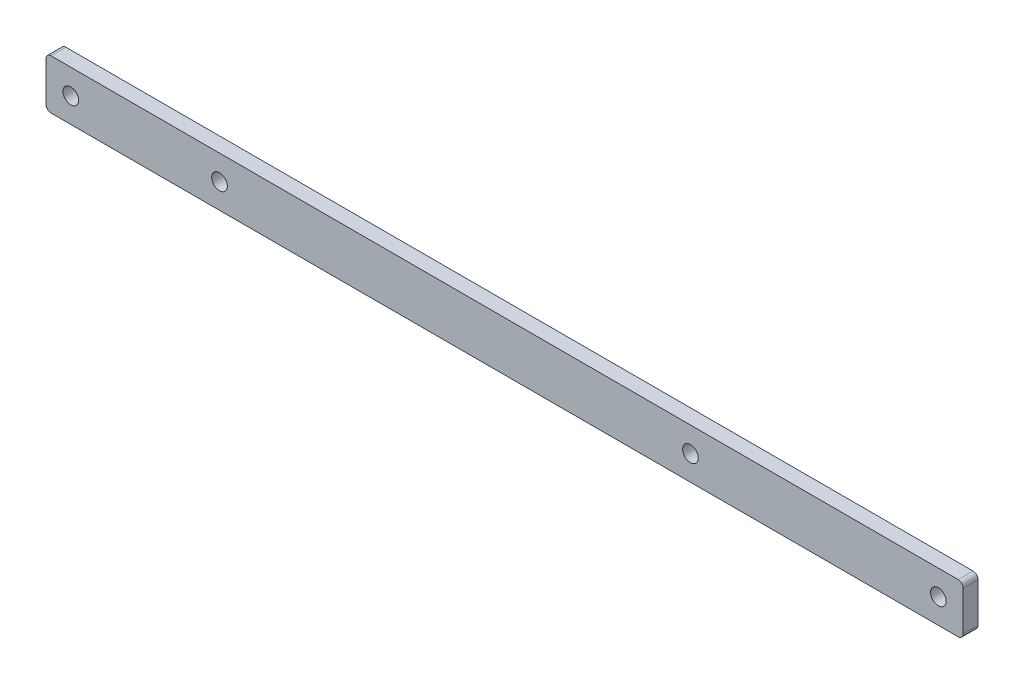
ISO-10303-21;
HEADER;
FILE_DESCRIPTION(('STEP AP214'),'2;1');
FILE_NAME('part.step','',(''),(''),'','','');
FILE_SCHEMA(('AUTOMOTIVE_DESIGN { 1 0 10303 214 1 1 1 1 }'));
ENDSEC;
DATA;
#1=APPLICATION_CONTEXT('core data for automotive mechanical design processes');
#2=APPLICATION_PROTOCOL_DEFINITION('international standard','automotive_design',2000,#1);
#3=PRODUCT_CONTEXT('',#1,'mechanical');
#4=PRODUCT('Part','Part','',(#3));
#5=PRODUCT_RELATED_PRODUCT_CATEGORY('part','',(#4));
#6=PRODUCT_DEFINITION_FORMATION('','',#4);
#7=PRODUCT_DEFINITION_CONTEXT('part definition',#1,'design');
#8=PRODUCT_DEFINITION('design','',#6,#7);
#9=PRODUCT_DEFINITION_SHAPE('','',#8);
#10=(LENGTH_UNIT() NAMED_UNIT(*) SI_UNIT(.MILLI.,.METRE.));
#11=(NAMED_UNIT(*) PLANE_ANGLE_UNIT() SI_UNIT($,.RADIAN.));
#12=(NAMED_UNIT(*) SI_UNIT($,.STERADIAN.) SOLID_ANGLE_UNIT());
#13=UNCERTAINTY_MEASURE_WITH_UNIT(LENGTH_MEASURE(1.E-05),#10,'distance_accuracy_value','');
#14=(GEOMETRIC_REPRESENTATION_CONTEXT(3) GLOBAL_UNCERTAINTY_ASSIGNED_CONTEXT((#13)) GLOBAL_UNIT_ASSIGNED_CONTEXT((#10,
#11,#12)) REPRESENTATION_CONTEXT('',''));
#15=CARTESIAN_POINT('',(0.,0.,0.));
#16=DIRECTION('',(0.,0.,1.));
#17=DIRECTION('',(1.,0.,0.));
#18=AXIS2_PLACEMENT_3D('',#15,#16,#17);
#19=CARTESIAN_POINT('',(0.,0.,7.62));
#20=DIRECTION('',(1.,0.,0.));
#21=DIRECTION('',(0.,0.,-1.));
#22=AXIS2_PLACEMENT_3D('',#19,#20,#21);
#23=PLANE('',#22);
#24=DIRECTION('',(0.,-1.,0.));
#25=VECTOR('',#24,1.);
#26=CARTESIAN_POINT('',(0.,0.,7.62));
#27=LINE('',#26,#25);
#28=CARTESIAN_POINT('',(0.,22.86,7.62));
#29=VERTEX_POINT('',#28);
#30=CARTESIAN_POINT('',(0.,2.54,7.62));
#31=VERTEX_POINT('',#30);
#32=EDGE_CURVE('E129',#29,#31,#27,.T.);
#33=ORIENTED_EDGE('',*,*,#32,.F.);
#34=DIRECTION('',(0.,0.,-1.));
#35=VECTOR('',#34,1.);
#36=CARTESIAN_POINT('',(0.,22.86,7.62));
#37=LINE('',#36,#35);
#38=CARTESIAN_POINT('',(0.,22.86,0.));
#39=VERTEX_POINT('',#38);
#40=EDGE_CURVE('E113',#29,#39,#37,.T.);
#41=ORIENTED_EDGE('',*,*,#40,.T.);
#42=DIRECTION('',(0.,-1.,0.));
#43=VECTOR('',#42,1.);
#44=CARTESIAN_POINT('',(0.,0.,0.));
#45=LINE('',#44,#43);
#46=CARTESIAN_POINT('',(0.,2.54,0.));
#47=VERTEX_POINT('',#46);
#48=EDGE_CURVE('E126',#39,#47,#45,.T.);
#49=ORIENTED_EDGE('',*,*,#48,.T.);
#50=DIRECTION('',(0.,0.,-1.));
#51=VECTOR('',#50,1.);
#52=CARTESIAN_POINT('',(0.,2.54,7.62));
#53=LINE('',#52,#51);
#54=EDGE_CURVE('E132',#47,#31,#53,.F.);
#55=ORIENTED_EDGE('',*,*,#54,.T.);
#56=EDGE_LOOP('',(#33,#41,#49,#55));
#57=FACE_BOUND('',#56,.T.);
#58=ADVANCED_FACE('F42',(#57),#23,.F.);
#59=CARTESIAN_POINT('',(0.,0.,7.62));
#60=DIRECTION('',(0.,1.,0.));
#61=DIRECTION('',(0.,0.,1.));
#62=AXIS2_PLACEMENT_3D('',#59,#60,#61);
#63=PLANE('',#62);
#64=DIRECTION('',(1.,0.,0.));
#65=VECTOR('',#64,1.);
#66=CARTESIAN_POINT('',(0.,0.,7.62));
#67=LINE('',#66,#65);
#68=CARTESIAN_POINT('',(2.54,0.,7.62));
#69=VERTEX_POINT('',#68);
#70=CARTESIAN_POINT('',(467.36,0.,7.62));
#71=VERTEX_POINT('',#70);
#72=EDGE_CURVE('E194',#69,#71,#67,.T.);
#73=ORIENTED_EDGE('',*,*,#72,.F.);
#74=DIRECTION('',(0.,0.,-1.));
#75=VECTOR('',#74,1.);
#76=CARTESIAN_POINT('',(2.54,0.,7.62));
#77=LINE('',#76,#75);
#78=CARTESIAN_POINT('',(2.54,0.,0.));
#79=VERTEX_POINT('',#78);
#80=EDGE_CURVE('E185',#69,#79,#77,.T.);
#81=ORIENTED_EDGE('',*,*,#80,.T.);
#82=DIRECTION('',(1.,0.,0.));
#83=VECTOR('',#82,1.);
#84=CARTESIAN_POINT('',(0.,0.,0.));
#85=LINE('',#84,#83);
#86=CARTESIAN_POINT('',(467.36,0.,0.));
#87=VERTEX_POINT('',#86);
#88=EDGE_CURVE('E137',#79,#87,#85,.T.);
#89=ORIENTED_EDGE('',*,*,#88,.T.);
#90=DIRECTION('',(0.,0.,-1.));
#91=VECTOR('',#90,1.);
#92=CARTESIAN_POINT('',(467.36,0.,7.62));
#93=LINE('',#92,#91);
#94=EDGE_CURVE('E182',#87,#71,#93,.F.);
#95=ORIENTED_EDGE('',*,*,#94,.T.);
#96=EDGE_LOOP('',(#73,#81,#89,#95));
#97=FACE_BOUND('',#96,.T.);
#98=ADVANCED_FACE('F260',(#97),#63,.F.);
#99=CARTESIAN_POINT('',(469.9,0.,7.62));
#100=DIRECTION('',(-1.,0.,0.));
#101=DIRECTION('',(0.,0.,1.));
#102=AXIS2_PLACEMENT_3D('',#99,#100,#101);
#103=PLANE('',#102);
#104=DIRECTION('',(0.,1.,0.));
#105=VECTOR('',#104,1.);
#106=CARTESIAN_POINT('',(469.9,0.,7.62));
#107=LINE('',#106,#105);
#108=CARTESIAN_POINT('',(469.9,2.54,7.62));
#109=VERTEX_POINT('',#108);
#110=CARTESIAN_POINT('',(469.9,22.86,7.62));
#111=VERTEX_POINT('',#110);
#112=EDGE_CURVE('E192',#109,#111,#107,.T.);
#113=ORIENTED_EDGE('',*,*,#112,.F.);
#114=DIRECTION('',(0.,0.,-1.));
#115=VECTOR('',#114,1.);
#116=CARTESIAN_POINT('',(469.9,2.54,7.62));
#117=LINE('',#116,#115);
#118=CARTESIAN_POINT('',(469.9,2.54,0.));
#119=VERTEX_POINT('',#118);
#120=EDGE_CURVE('E11',#109,#119,#117,.T.);
#121=ORIENTED_EDGE('',*,*,#120,.T.);
#122=DIRECTION('',(0.,1.,0.));
#123=VECTOR('',#122,1.);
#124=CARTESIAN_POINT('',(469.9,0.,0.));
#125=LINE('',#124,#123);
#126=CARTESIAN_POINT('',(469.9,22.86,0.));
#127=VERTEX_POINT('',#126);
#128=EDGE_CURVE('E143',#119,#127,#125,.T.);
#129=ORIENTED_EDGE('',*,*,#128,.T.);
#130=DIRECTION('',(0.,0.,-1.));
#131=VECTOR('',#130,1.);
#132=CARTESIAN_POINT('',(469.9,22.86,7.62));
#133=LINE('',#132,#131);
#134=EDGE_CURVE('E51',#127,#111,#133,.F.);
#135=ORIENTED_EDGE('',*,*,#134,.T.);
#136=EDGE_LOOP('',(#113,#121,#129,#135));
#137=FACE_BOUND('',#136,.T.);
#138=ADVANCED_FACE('F253',(#137),#103,.F.);
#139=CARTESIAN_POINT('',(0.,25.4,7.62));
#140=DIRECTION('',(0.,-1.,0.));
#141=DIRECTION('',(0.,0.,-1.));
#142=AXIS2_PLACEMENT_3D('',#139,#140,#141);
#143=PLANE('',#142);
#144=DIRECTION('',(-1.,0.,0.));
#145=VECTOR('',#144,1.);
#146=CARTESIAN_POINT('',(0.,25.4,0.));
#147=LINE('',#146,#145);
#148=CARTESIAN_POINT('',(467.36,25.4,0.));
#149=VERTEX_POINT('',#148);
#150=CARTESIAN_POINT('',(2.54,25.4,0.));
#151=VERTEX_POINT('',#150);
#152=EDGE_CURVE('E154',#149,#151,#147,.T.);
#153=ORIENTED_EDGE('',*,*,#152,.T.);
#154=DIRECTION('',(0.,0.,-1.));
#155=VECTOR('',#154,1.);
#156=CARTESIAN_POINT('',(2.54,25.4,7.62));
#157=LINE('',#156,#155);
#158=CARTESIAN_POINT('',(2.54,25.4,7.62));
#159=VERTEX_POINT('',#158);
#160=EDGE_CURVE('E114',#151,#159,#157,.F.);
#161=ORIENTED_EDGE('',*,*,#160,.T.);
#162=DIRECTION('',(-1.,0.,0.));
#163=VECTOR('',#162,1.);
#164=CARTESIAN_POINT('',(0.,25.4,7.62));
#165=LINE('',#164,#163);
#166=CARTESIAN_POINT('',(467.36,25.4,7.62));
#167=VERTEX_POINT('',#166);
#168=EDGE_CURVE('E149',#167,#159,#165,.T.);
#169=ORIENTED_EDGE('',*,*,#168,.F.);
#170=DIRECTION('',(0.,0.,-1.));
#171=VECTOR('',#170,1.);
#172=CARTESIAN_POINT('',(467.36,25.4,7.62));
#173=LINE('',#172,#171);
#174=EDGE_CURVE('E120',#167,#149,#173,.T.);
#175=ORIENTED_EDGE('',*,*,#174,.T.);
#176=EDGE_LOOP('',(#153,#161,#169,#175));
#177=FACE_BOUND('',#176,.T.);
#178=ADVANCED_FACE('F240',(#177),#143,.F.);
#179=CARTESIAN_POINT('',(0.,0.,7.62));
#180=DIRECTION('',(0.,0.,-1.));
#181=DIRECTION('',(-1.,0.,0.));
#182=AXIS2_PLACEMENT_3D('',#179,#180,#181);
#183=PLANE('',#182);
#184=CARTESIAN_POINT('',(88.9,12.7,7.62));
#185=DIRECTION('',(0.,0.,1.));
#186=DIRECTION('',(1.,0.,0.));
#187=AXIS2_PLACEMENT_3D('',#184,#185,#186);
#188=CIRCLE('',#187,4.00000000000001);
#189=CARTESIAN_POINT('',(92.9,12.7,7.62));
#190=VERTEX_POINT('',#189);
#191=EDGE_CURVE('E220',#190,#190,#188,.T.);
#192=ORIENTED_EDGE('',*,*,#191,.F.);
#193=EDGE_LOOP('',(#192));
#194=FACE_BOUND('',#193,.T.);
#195=CARTESIAN_POINT('',(330.2,12.7,7.62));
#196=DIRECTION('',(0.,0.,1.));
#197=DIRECTION('',(1.,0.,0.));
#198=AXIS2_PLACEMENT_3D('',#195,#196,#197);
#199=CIRCLE('',#198,3.99999999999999);
#200=CARTESIAN_POINT('',(334.2,12.7,7.62));
#201=VERTEX_POINT('',#200);
#202=EDGE_CURVE('E216',#201,#201,#199,.T.);
#203=ORIENTED_EDGE('',*,*,#202,.F.);
#204=EDGE_LOOP('',(#203));
#205=FACE_BOUND('',#204,.T.);
#206=CARTESIAN_POINT('',(457.2,12.6999999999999,7.62));
#207=DIRECTION('',(0.,0.,-1.));
#208=DIRECTION('',(-1.,0.,0.));
#209=AXIS2_PLACEMENT_3D('',#206,#207,#208);
#210=CIRCLE('',#209,4.);
#211=CARTESIAN_POINT('',(461.2,12.6999999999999,7.62));
#212=VERTEX_POINT('',#211);
#213=EDGE_CURVE('E204',#212,#212,#210,.T.);
#214=ORIENTED_EDGE('',*,*,#213,.T.);
#215=EDGE_LOOP('',(#214));
#216=FACE_BOUND('',#215,.T.);
#217=CARTESIAN_POINT('',(12.7,12.6999999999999,7.62));
#218=DIRECTION('',(0.,0.,1.));
#219=DIRECTION('',(1.,0.,0.));
#220=AXIS2_PLACEMENT_3D('',#217,#218,#219);
#221=CIRCLE('',#220,4.);
#222=CARTESIAN_POINT('',(16.7,12.6999999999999,7.62));
#223=VERTEX_POINT('',#222);
#224=EDGE_CURVE('E146',#223,#223,#221,.T.);
#225=ORIENTED_EDGE('',*,*,#224,.F.);
#226=EDGE_LOOP('',(#225));
#227=FACE_BOUND('',#226,.T.);
#228=ORIENTED_EDGE('',*,*,#168,.T.);
#229=CARTESIAN_POINT('',(2.54,22.86,7.62));
#230=DIRECTION('',(0.,0.,-1.));
#231=DIRECTION('',(-1.,0.,0.));
#232=AXIS2_PLACEMENT_3D('',#229,#230,#231);
#233=CIRCLE('',#232,2.54);
#234=EDGE_CURVE('E179',#159,#29,#233,.F.);
#235=ORIENTED_EDGE('',*,*,#234,.T.);
#236=ORIENTED_EDGE('',*,*,#32,.T.);
#237=CARTESIAN_POINT('',(2.54,2.54,7.62));
#238=DIRECTION('',(0.,0.,-1.));
#239=DIRECTION('',(-1.,0.,0.));
#240=AXIS2_PLACEMENT_3D('',#237,#238,#239);
#241=CIRCLE('',#240,2.54);
#242=EDGE_CURVE('E176',#31,#69,#241,.F.);
#243=ORIENTED_EDGE('',*,*,#242,.T.);
#244=ORIENTED_EDGE('',*,*,#72,.T.);
#245=CARTESIAN_POINT('',(467.36,2.54,7.62));
#246=DIRECTION('',(0.,0.,-1.));
#247=DIRECTION('',(-1.,0.,0.));
#248=AXIS2_PLACEMENT_3D('',#245,#246,#247);
#249=CIRCLE('',#248,2.54);
#250=EDGE_CURVE('E64',#71,#109,#249,.F.);
#251=ORIENTED_EDGE('',*,*,#250,.T.);
#252=ORIENTED_EDGE('',*,*,#112,.T.);
#253=CARTESIAN_POINT('',(467.36,22.86,7.62));
#254=DIRECTION('',(0.,0.,-1.));
#255=DIRECTION('',(-1.,0.,0.));
#256=AXIS2_PLACEMENT_3D('',#253,#254,#255);
#257=CIRCLE('',#256,2.54);
#258=EDGE_CURVE('E171',#111,#167,#257,.F.);
#259=ORIENTED_EDGE('',*,*,#258,.T.);
#260=EDGE_LOOP('',(#228,#235,#236,#243,#244,#251,#252,#259));
#261=FACE_BOUND('',#260,.T.);
#262=ADVANCED_FACE('F237',(#194,#205,#216,#227,#261),#183,.F.);
#263=CARTESIAN_POINT('',(0.,0.,0.));
#264=DIRECTION('',(0.,0.,-1.));
#265=DIRECTION('',(-1.,0.,0.));
#266=AXIS2_PLACEMENT_3D('',#263,#264,#265);
#267=PLANE('',#266);
#268=CARTESIAN_POINT('',(88.9,12.7,0.));
#269=DIRECTION('',(0.,0.,1.));
#270=DIRECTION('',(1.,0.,0.));
#271=AXIS2_PLACEMENT_3D('',#268,#269,#270);
#272=CIRCLE('',#271,4.00000000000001);
#273=CARTESIAN_POINT('',(92.9,12.7,0.));
#274=VERTEX_POINT('',#273);
#275=EDGE_CURVE('E208',#274,#274,#272,.T.);
#276=ORIENTED_EDGE('',*,*,#275,.T.);
#277=EDGE_LOOP('',(#276));
#278=FACE_BOUND('',#277,.T.);
#279=CARTESIAN_POINT('',(330.2,12.7,0.));
#280=DIRECTION('',(0.,0.,1.));
#281=DIRECTION('',(1.,0.,0.));
#282=AXIS2_PLACEMENT_3D('',#279,#280,#281);
#283=CIRCLE('',#282,3.99999999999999);
#284=CARTESIAN_POINT('',(334.2,12.7,0.));
#285=VERTEX_POINT('',#284);
#286=EDGE_CURVE('E212',#285,#285,#283,.T.);
#287=ORIENTED_EDGE('',*,*,#286,.T.);
#288=EDGE_LOOP('',(#287));
#289=FACE_BOUND('',#288,.T.);
#290=CARTESIAN_POINT('',(457.2,12.6999999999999,0.));
#291=DIRECTION('',(0.,0.,-1.));
#292=DIRECTION('',(-1.,0.,0.));
#293=AXIS2_PLACEMENT_3D('',#290,#291,#292);
#294=CIRCLE('',#293,4.);
#295=CARTESIAN_POINT('',(461.2,12.6999999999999,0.));
#296=VERTEX_POINT('',#295);
#297=EDGE_CURVE('E202',#296,#296,#294,.T.);
#298=ORIENTED_EDGE('',*,*,#297,.F.);
#299=EDGE_LOOP('',(#298));
#300=FACE_BOUND('',#299,.T.);
#301=CARTESIAN_POINT('',(12.7,12.6999999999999,0.));
#302=DIRECTION('',(0.,0.,1.));
#303=DIRECTION('',(1.,0.,0.));
#304=AXIS2_PLACEMENT_3D('',#301,#302,#303);
#305=CIRCLE('',#304,4.);
#306=CARTESIAN_POINT('',(16.7,12.6999999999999,0.));
#307=VERTEX_POINT('',#306);
#308=EDGE_CURVE('E138',#307,#307,#305,.T.);
#309=ORIENTED_EDGE('',*,*,#308,.T.);
#310=EDGE_LOOP('',(#309));
#311=FACE_BOUND('',#310,.T.);
#312=ORIENTED_EDGE('',*,*,#48,.F.);
#313=CARTESIAN_POINT('',(2.54,22.86,0.));
#314=DIRECTION('',(0.,0.,-1.));
#315=DIRECTION('',(-1.,0.,0.));
#316=AXIS2_PLACEMENT_3D('',#313,#314,#315);
#317=CIRCLE('',#316,2.54);
#318=EDGE_CURVE('E109',#39,#151,#317,.T.);
#319=ORIENTED_EDGE('',*,*,#318,.T.);
#320=ORIENTED_EDGE('',*,*,#152,.F.);
#321=CARTESIAN_POINT('',(467.36,22.86,0.));
#322=DIRECTION('',(0.,0.,-1.));
#323=DIRECTION('',(-1.,0.,0.));
#324=AXIS2_PLACEMENT_3D('',#321,#322,#323);
#325=CIRCLE('',#324,2.54);
#326=EDGE_CURVE('E131',#149,#127,#325,.T.);
#327=ORIENTED_EDGE('',*,*,#326,.T.);
#328=ORIENTED_EDGE('',*,*,#128,.F.);
#329=CARTESIAN_POINT('',(467.36,2.54,0.));
#330=DIRECTION('',(0.,0.,-1.));
#331=DIRECTION('',(-1.,0.,0.));
#332=AXIS2_PLACEMENT_3D('',#329,#330,#331);
#333=CIRCLE('',#332,2.54);
#334=EDGE_CURVE('E161',#119,#87,#333,.T.);
#335=ORIENTED_EDGE('',*,*,#334,.T.);
#336=ORIENTED_EDGE('',*,*,#88,.F.);
#337=CARTESIAN_POINT('',(2.54,2.54,0.));
#338=DIRECTION('',(0.,0.,-1.));
#339=DIRECTION('',(-1.,0.,0.));
#340=AXIS2_PLACEMENT_3D('',#337,#338,#339);
#341=CIRCLE('',#340,2.54);
#342=EDGE_CURVE('E121',#79,#47,#341,.T.);
#343=ORIENTED_EDGE('',*,*,#342,.T.);
#344=EDGE_LOOP('',(#312,#319,#320,#327,#328,#335,#336,#343));
#345=FACE_BOUND('',#344,.T.);
#346=ADVANCED_FACE('F134',(#278,#289,#300,#311,#345),#267,.T.);
#347=CARTESIAN_POINT('',(12.7,12.6999999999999,0.));
#348=DIRECTION('',(0.,0.,1.));
#349=DIRECTION('',(1.,0.,0.));
#350=AXIS2_PLACEMENT_3D('',#347,#348,#349);
#351=CYLINDRICAL_SURFACE('',#350,4.);
#352=CARTESIAN_POINT('',(16.7,12.6999999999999,0.));
#353=CARTESIAN_POINT('',(16.7,12.6999999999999,0.0793749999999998));
#354=CARTESIAN_POINT('',(16.7,12.6999999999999,0.15875));
#355=CARTESIAN_POINT('',(16.7,12.6999999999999,0.3175));
#356=CARTESIAN_POINT('',(16.7,12.6999999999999,0.396875));
#357=CARTESIAN_POINT('',(16.7,12.6999999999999,0.555625));
#358=CARTESIAN_POINT('',(16.7,12.6999999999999,0.635));
#359=CARTESIAN_POINT('',(16.7,12.6999999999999,0.79375));
#360=CARTESIAN_POINT('',(16.7,12.6999999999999,0.873125));
#361=CARTESIAN_POINT('',(16.7,12.6999999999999,1.031875));
#362=CARTESIAN_POINT('',(16.7,12.6999999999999,1.11125));
#363=CARTESIAN_POINT('',(16.7,12.6999999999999,1.27));
#364=CARTESIAN_POINT('',(16.7,12.6999999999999,1.349375));
#365=CARTESIAN_POINT('',(16.7,12.6999999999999,1.508125));
#366=CARTESIAN_POINT('',(16.7,12.6999999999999,1.5875));
#367=CARTESIAN_POINT('',(16.7,12.6999999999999,1.74625));
#368=CARTESIAN_POINT('',(16.7,12.6999999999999,1.825625));
#369=CARTESIAN_POINT('',(16.7,12.6999999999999,1.984375));
#370=CARTESIAN_POINT('',(16.7,12.6999999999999,2.06375));
#371=CARTESIAN_POINT('',(16.7,12.6999999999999,2.2225));
#372=CARTESIAN_POINT('',(16.7,12.6999999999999,2.301875));
#373=CARTESIAN_POINT('',(16.7,12.6999999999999,2.460625));
#374=CARTESIAN_POINT('',(16.7,12.6999999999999,2.54));
#375=CARTESIAN_POINT('',(16.7,12.6999999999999,2.69875));
#376=CARTESIAN_POINT('',(16.7,12.6999999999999,2.778125));
#377=CARTESIAN_POINT('',(16.7,12.6999999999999,2.936875));
#378=CARTESIAN_POINT('',(16.7,12.6999999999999,3.01625));
#379=CARTESIAN_POINT('',(16.7,12.6999999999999,3.175));
#380=CARTESIAN_POINT('',(16.7,12.6999999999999,3.254375));
#381=CARTESIAN_POINT('',(16.7,12.6999999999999,3.413125));
#382=CARTESIAN_POINT('',(16.7,12.6999999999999,3.4925));
#383=CARTESIAN_POINT('',(16.7,12.6999999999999,3.65125));
#384=CARTESIAN_POINT('',(16.7,12.6999999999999,3.730625));
#385=CARTESIAN_POINT('',(16.7,12.6999999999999,3.889375));
#386=CARTESIAN_POINT('',(16.7,12.6999999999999,3.96875));
#387=CARTESIAN_POINT('',(16.7,12.6999999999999,4.1275));
#388=CARTESIAN_POINT('',(16.7,12.6999999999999,4.206875));
#389=CARTESIAN_POINT('',(16.7,12.6999999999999,4.365625));
#390=CARTESIAN_POINT('',(16.7,12.6999999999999,4.445));
#391=CARTESIAN_POINT('',(16.7,12.6999999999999,4.60375));
#392=CARTESIAN_POINT('',(16.7,12.6999999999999,4.683125));
#393=CARTESIAN_POINT('',(16.7,12.6999999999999,4.841875));
#394=CARTESIAN_POINT('',(16.7,12.6999999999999,4.92125));
#395=CARTESIAN_POINT('',(16.7,12.6999999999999,5.08));
#396=CARTESIAN_POINT('',(16.7,12.6999999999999,5.159375));
#397=CARTESIAN_POINT('',(16.7,12.6999999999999,5.318125));
#398=CARTESIAN_POINT('',(16.7,12.6999999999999,5.3975));
#399=CARTESIAN_POINT('',(16.7,12.6999999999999,5.55625));
#400=CARTESIAN_POINT('',(16.7,12.6999999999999,5.635625));
#401=CARTESIAN_POINT('',(16.7,12.6999999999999,5.794375));
#402=CARTESIAN_POINT('',(16.7,12.6999999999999,5.87375));
#403=CARTESIAN_POINT('',(16.7,12.6999999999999,6.0325));
#404=CARTESIAN_POINT('',(16.7,12.6999999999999,6.111875));
#405=CARTESIAN_POINT('',(16.7,12.6999999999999,6.270625));
#406=CARTESIAN_POINT('',(16.7,12.6999999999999,6.35));
#407=CARTESIAN_POINT('',(16.7,12.6999999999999,6.50875));
#408=CARTESIAN_POINT('',(16.7,12.6999999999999,6.588125));
#409=CARTESIAN_POINT('',(16.7,12.6999999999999,6.746875));
#410=CARTESIAN_POINT('',(16.7,12.6999999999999,6.82625));
#411=CARTESIAN_POINT('',(16.7,12.6999999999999,6.985));
#412=CARTESIAN_POINT('',(16.7,12.6999999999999,7.064375));
#413=CARTESIAN_POINT('',(16.7,12.6999999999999,7.223125));
#414=CARTESIAN_POINT('',(16.7,12.6999999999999,7.3025));
#415=CARTESIAN_POINT('',(16.7,12.6999999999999,7.46125));
#416=CARTESIAN_POINT('',(16.7,12.6999999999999,7.540625));
#417=CARTESIAN_POINT('',(16.7,12.6999999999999,7.62));
#418=B_SPLINE_CURVE_WITH_KNOTS('',3,(#352,#353,#354,#355,#356,#357,#358,#359,#360,#361,#362,
#363,#364,#365,#366,#367,#368,#369,#370,#371,#372,#373,#374,#375,#376,#377,#378,#379,#380,#381,
#382,#383,#384,#385,#386,#387,#388,#389,#390,#391,#392,#393,#394,#395,#396,#397,#398,#399,#400,
#401,#402,#403,#404,#405,#406,#407,#408,#409,#410,#411,#412,#413,#414,#415,#416,#417),
.UNSPECIFIED.,.F.,.F.,(4,2,2,2,2,2,2,2,2,2,2,2,2,2,2,2,2,2,2,2,2,2,2,2,2,2,2,2,2,2,2,2,4),(0.,
0.238125,0.47625,0.714375,0.9525,1.190625,1.42875,1.666875,1.905,2.143125,2.38125,2.619375,
2.8575,3.095625,3.33375,3.571875,3.81,4.048125,4.28625,4.524375,4.7625,5.000625,5.23875,
5.476875,5.715,5.953125,6.19125,6.429375,6.6675,6.905625,7.14375,7.381875,7.62),.UNSPECIFIED.);
#419=EDGE_CURVE('BSEAM284',#307,#223,#418,.T.);
#420=ORIENTED_EDGE('',*,*,#308,.F.);
#421=ORIENTED_EDGE('',*,*,#224,.T.);
#422=ORIENTED_EDGE('',*,*,#419,.T.);
#423=ORIENTED_EDGE('',*,*,#419,.F.);
#424=EDGE_LOOP('',(#420,#422,#421,#423));
#425=FACE_BOUND('',#424,.T.);
#426=ADVANCED_FACE('F284',(#425),#351,.F.);
#427=CARTESIAN_POINT('',(457.2,12.6999999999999,0.));
#428=DIRECTION('',(0.,0.,1.));
#429=DIRECTION('',(1.,0.,0.));
#430=AXIS2_PLACEMENT_3D('',#427,#428,#429);
#431=CYLINDRICAL_SURFACE('',#430,4.);
#432=CARTESIAN_POINT('',(461.2,12.6999999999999,0.));
#433=CARTESIAN_POINT('',(461.2,12.6999999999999,0.0793749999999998));
#434=CARTESIAN_POINT('',(461.2,12.6999999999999,0.15875));
#435=CARTESIAN_POINT('',(461.2,12.6999999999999,0.3175));
#436=CARTESIAN_POINT('',(461.2,12.6999999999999,0.396875));
#437=CARTESIAN_POINT('',(461.2,12.6999999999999,0.555625));
#438=CARTESIAN_POINT('',(461.2,12.6999999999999,0.635));
#439=CARTESIAN_POINT('',(461.2,12.6999999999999,0.79375));
#440=CARTESIAN_POINT('',(461.2,12.6999999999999,0.873125));
#441=CARTESIAN_POINT('',(461.2,12.6999999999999,1.031875));
#442=CARTESIAN_POINT('',(461.2,12.6999999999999,1.11125));
#443=CARTESIAN_POINT('',(461.2,12.6999999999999,1.27));
#444=CARTESIAN_POINT('',(461.2,12.6999999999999,1.349375));
#445=CARTESIAN_POINT('',(461.2,12.6999999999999,1.508125));
#446=CARTESIAN_POINT('',(461.2,12.6999999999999,1.5875));
#447=CARTESIAN_POINT('',(461.2,12.6999999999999,1.74625));
#448=CARTESIAN_POINT('',(461.2,12.6999999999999,1.825625));
#449=CARTESIAN_POINT('',(461.2,12.6999999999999,1.984375));
#450=CARTESIAN_POINT('',(461.2,12.6999999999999,2.06375));
#451=CARTESIAN_POINT('',(461.2,12.6999999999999,2.2225));
#452=CARTESIAN_POINT('',(461.2,12.6999999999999,2.301875));
#453=CARTESIAN_POINT('',(461.2,12.6999999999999,2.460625));
#454=CARTESIAN_POINT('',(461.2,12.6999999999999,2.54));
#455=CARTESIAN_POINT('',(461.2,12.6999999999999,2.69875));
#456=CARTESIAN_POINT('',(461.2,12.6999999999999,2.778125));
#457=CARTESIAN_POINT('',(461.2,12.6999999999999,2.936875));
#458=CARTESIAN_POINT('',(461.2,12.6999999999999,3.01625));
#459=CARTESIAN_POINT('',(461.2,12.6999999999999,3.175));
#460=CARTESIAN_POINT('',(461.2,12.6999999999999,3.254375));
#461=CARTESIAN_POINT('',(461.2,12.6999999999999,3.413125));
#462=CARTESIAN_POINT('',(461.2,12.6999999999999,3.4925));
#463=CARTESIAN_POINT('',(461.2,12.6999999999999,3.65125));
#464=CARTESIAN_POINT('',(461.2,12.6999999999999,3.730625));
#465=CARTESIAN_POINT('',(461.2,12.6999999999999,3.889375));
#466=CARTESIAN_POINT('',(461.2,12.6999999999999,3.96875));
#467=CARTESIAN_POINT('',(461.2,12.6999999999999,4.1275));
#468=CARTESIAN_POINT('',(461.2,12.6999999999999,4.206875));
#469=CARTESIAN_POINT('',(461.2,12.6999999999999,4.365625));
#470=CARTESIAN_POINT('',(461.2,12.6999999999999,4.445));
#471=CARTESIAN_POINT('',(461.2,12.6999999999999,4.60375));
#472=CARTESIAN_POINT('',(461.2,12.6999999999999,4.683125));
#473=CARTESIAN_POINT('',(461.2,12.6999999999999,4.841875));
#474=CARTESIAN_POINT('',(461.2,12.6999999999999,4.92125));
#475=CARTESIAN_POINT('',(461.2,12.6999999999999,5.08));
#476=CARTESIAN_POINT('',(461.2,12.6999999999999,5.159375));
#477=CARTESIAN_POINT('',(461.2,12.6999999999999,5.318125));
#478=CARTESIAN_POINT('',(461.2,12.6999999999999,5.3975));
#479=CARTESIAN_POINT('',(461.2,12.6999999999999,5.55625));
#480=CARTESIAN_POINT('',(461.2,12.6999999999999,5.635625));
#481=CARTESIAN_POINT('',(461.2,12.6999999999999,5.794375));
#482=CARTESIAN_POINT('',(461.2,12.6999999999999,5.87375));
#483=CARTESIAN_POINT('',(461.2,12.6999999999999,6.0325));
#484=CARTESIAN_POINT('',(461.2,12.6999999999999,6.111875));
#485=CARTESIAN_POINT('',(461.2,12.6999999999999,6.270625));
#486=CARTESIAN_POINT('',(461.2,12.6999999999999,6.35));
#487=CARTESIAN_POINT('',(461.2,12.6999999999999,6.50875));
#488=CARTESIAN_POINT('',(461.2,12.6999999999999,6.588125));
#489=CARTESIAN_POINT('',(461.2,12.6999999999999,6.746875));
#490=CARTESIAN_POINT('',(461.2,12.6999999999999,6.82625));
#491=CARTESIAN_POINT('',(461.2,12.6999999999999,6.985));
#492=CARTESIAN_POINT('',(461.2,12.6999999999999,7.064375));
#493=CARTESIAN_POINT('',(461.2,12.6999999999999,7.223125));
#494=CARTESIAN_POINT('',(461.2,12.6999999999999,7.3025));
#495=CARTESIAN_POINT('',(461.2,12.6999999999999,7.46125));
#496=CARTESIAN_POINT('',(461.2,12.6999999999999,7.540625));
#497=CARTESIAN_POINT('',(461.2,12.6999999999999,7.62));
#498=B_SPLINE_CURVE_WITH_KNOTS('',3,(#432,#433,#434,#435,#436,#437,#438,#439,#440,#441,#442,
#443,#444,#445,#446,#447,#448,#449,#450,#451,#452,#453,#454,#455,#456,#457,#458,#459,#460,#461,
#462,#463,#464,#465,#466,#467,#468,#469,#470,#471,#472,#473,#474,#475,#476,#477,#478,#479,#480,
#481,#482,#483,#484,#485,#486,#487,#488,#489,#490,#491,#492,#493,#494,#495,#496,#497),
.UNSPECIFIED.,.F.,.F.,(4,2,2,2,2,2,2,2,2,2,2,2,2,2,2,2,2,2,2,2,2,2,2,2,2,2,2,2,2,2,2,2,4),(0.,
0.238125,0.47625,0.714375,0.9525,1.190625,1.42875,1.666875,1.905,2.143125,2.38125,2.619375,
2.8575,3.095625,3.33375,3.571875,3.81,4.048125,4.28625,4.524375,4.7625,5.000625,5.23875,
5.476875,5.715,5.953125,6.19125,6.429375,6.6675,6.905625,7.14375,7.381875,7.62),.UNSPECIFIED.);
#499=EDGE_CURVE('BSEAM270',#296,#212,#498,.T.);
#500=ORIENTED_EDGE('',*,*,#297,.T.);
#501=ORIENTED_EDGE('',*,*,#213,.F.);
#502=ORIENTED_EDGE('',*,*,#499,.T.);
#503=ORIENTED_EDGE('',*,*,#499,.F.);
#504=EDGE_LOOP('',(#500,#502,#501,#503));
#505=FACE_BOUND('',#504,.T.);
#506=ADVANCED_FACE('F270',(#505),#431,.F.);
#507=CARTESIAN_POINT('',(2.54,22.86,7.62));
#508=DIRECTION('',(0.,0.,-1.));
#509=DIRECTION('',(-1.,0.,0.));
#510=AXIS2_PLACEMENT_3D('',#507,#508,#509);
#511=CYLINDRICAL_SURFACE('',#510,2.54);
#512=ORIENTED_EDGE('',*,*,#234,.F.);
#513=ORIENTED_EDGE('',*,*,#160,.F.);
#514=ORIENTED_EDGE('',*,*,#318,.F.);
#515=ORIENTED_EDGE('',*,*,#40,.F.);
#516=EDGE_LOOP('',(#512,#513,#514,#515));
#517=FACE_BOUND('',#516,.T.);
#518=ADVANCED_FACE('F112',(#517),#511,.T.);
#519=CARTESIAN_POINT('',(2.54,2.54,7.62));
#520=DIRECTION('',(0.,0.,-1.));
#521=DIRECTION('',(-1.,0.,0.));
#522=AXIS2_PLACEMENT_3D('',#519,#520,#521);
#523=CYLINDRICAL_SURFACE('',#522,2.54);
#524=ORIENTED_EDGE('',*,*,#242,.F.);
#525=ORIENTED_EDGE('',*,*,#54,.F.);
#526=ORIENTED_EDGE('',*,*,#342,.F.);
#527=ORIENTED_EDGE('',*,*,#80,.F.);
#528=EDGE_LOOP('',(#524,#525,#526,#527));
#529=FACE_BOUND('',#528,.T.);
#530=ADVANCED_FACE('F263',(#529),#523,.T.);
#531=CARTESIAN_POINT('',(467.36,2.54,7.62));
#532=DIRECTION('',(0.,0.,-1.));
#533=DIRECTION('',(-1.,0.,0.));
#534=AXIS2_PLACEMENT_3D('',#531,#532,#533);
#535=CYLINDRICAL_SURFACE('',#534,2.54);
#536=ORIENTED_EDGE('',*,*,#250,.F.);
#537=ORIENTED_EDGE('',*,*,#94,.F.);
#538=ORIENTED_EDGE('',*,*,#334,.F.);
#539=ORIENTED_EDGE('',*,*,#120,.F.);
#540=EDGE_LOOP('',(#536,#537,#538,#539));
#541=FACE_BOUND('',#540,.T.);
#542=ADVANCED_FACE('F256',(#541),#535,.T.);
#543=CARTESIAN_POINT('',(467.36,22.86,7.62));
#544=DIRECTION('',(0.,0.,-1.));
#545=DIRECTION('',(-1.,0.,0.));
#546=AXIS2_PLACEMENT_3D('',#543,#544,#545);
#547=CYLINDRICAL_SURFACE('',#546,2.54);
#548=ORIENTED_EDGE('',*,*,#258,.F.);
#549=ORIENTED_EDGE('',*,*,#134,.F.);
#550=ORIENTED_EDGE('',*,*,#326,.F.);
#551=ORIENTED_EDGE('',*,*,#174,.F.);
#552=EDGE_LOOP('',(#548,#549,#550,#551));
#553=FACE_BOUND('',#552,.T.);
#554=ADVANCED_FACE('F44',(#553),#547,.T.);
#555=CARTESIAN_POINT('',(330.2,12.7,0.));
#556=DIRECTION('',(0.,0.,1.));
#557=DIRECTION('',(1.,0.,0.));
#558=AXIS2_PLACEMENT_3D('',#555,#556,#557);
#559=CYLINDRICAL_SURFACE('',#558,3.99999999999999);
#560=CARTESIAN_POINT('',(334.2,12.7,0.));
#561=CARTESIAN_POINT('',(334.2,12.7,0.0793749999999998));
#562=CARTESIAN_POINT('',(334.2,12.7,0.15875));
#563=CARTESIAN_POINT('',(334.2,12.7,0.3175));
#564=CARTESIAN_POINT('',(334.2,12.7,0.396875));
#565=CARTESIAN_POINT('',(334.2,12.7,0.555625));
#566=CARTESIAN_POINT('',(334.2,12.7,0.635));
#567=CARTESIAN_POINT('',(334.2,12.7,0.79375));
#568=CARTESIAN_POINT('',(334.2,12.7,0.873125));
#569=CARTESIAN_POINT('',(334.2,12.7,1.031875));
#570=CARTESIAN_POINT('',(334.2,12.7,1.11125));
#571=CARTESIAN_POINT('',(334.2,12.7,1.27));
#572=CARTESIAN_POINT('',(334.2,12.7,1.349375));
#573=CARTESIAN_POINT('',(334.2,12.7,1.508125));
#574=CARTESIAN_POINT('',(334.2,12.7,1.5875));
#575=CARTESIAN_POINT('',(334.2,12.7,1.74625));
#576=CARTESIAN_POINT('',(334.2,12.7,1.825625));
#577=CARTESIAN_POINT('',(334.2,12.7,1.984375));
#578=CARTESIAN_POINT('',(334.2,12.7,2.06375));
#579=CARTESIAN_POINT('',(334.2,12.7,2.2225));
#580=CARTESIAN_POINT('',(334.2,12.7,2.301875));
#581=CARTESIAN_POINT('',(334.2,12.7,2.460625));
#582=CARTESIAN_POINT('',(334.2,12.7,2.54));
#583=CARTESIAN_POINT('',(334.2,12.7,2.69875));
#584=CARTESIAN_POINT('',(334.2,12.7,2.778125));
#585=CARTESIAN_POINT('',(334.2,12.7,2.936875));
#586=CARTESIAN_POINT('',(334.2,12.7,3.01625));
#587=CARTESIAN_POINT('',(334.2,12.7,3.175));
#588=CARTESIAN_POINT('',(334.2,12.7,3.254375));
#589=CARTESIAN_POINT('',(334.2,12.7,3.413125));
#590=CARTESIAN_POINT('',(334.2,12.7,3.4925));
#591=CARTESIAN_POINT('',(334.2,12.7,3.65125));
#592=CARTESIAN_POINT('',(334.2,12.7,3.730625));
#593=CARTESIAN_POINT('',(334.2,12.7,3.889375));
#594=CARTESIAN_POINT('',(334.2,12.7,3.96875));
#595=CARTESIAN_POINT('',(334.2,12.7,4.1275));
#596=CARTESIAN_POINT('',(334.2,12.7,4.206875));
#597=CARTESIAN_POINT('',(334.2,12.7,4.365625));
#598=CARTESIAN_POINT('',(334.2,12.7,4.445));
#599=CARTESIAN_POINT('',(334.2,12.7,4.60375));
#600=CARTESIAN_POINT('',(334.2,12.7,4.683125));
#601=CARTESIAN_POINT('',(334.2,12.7,4.841875));
#602=CARTESIAN_POINT('',(334.2,12.7,4.92125));
#603=CARTESIAN_POINT('',(334.2,12.7,5.08));
#604=CARTESIAN_POINT('',(334.2,12.7,5.159375));
#605=CARTESIAN_POINT('',(334.2,12.7,5.318125));
#606=CARTESIAN_POINT('',(334.2,12.7,5.3975));
#607=CARTESIAN_POINT('',(334.2,12.7,5.55625));
#608=CARTESIAN_POINT('',(334.2,12.7,5.635625));
#609=CARTESIAN_POINT('',(334.2,12.7,5.794375));
#610=CARTESIAN_POINT('',(334.2,12.7,5.87375));
#611=CARTESIAN_POINT('',(334.2,12.7,6.0325));
#612=CARTESIAN_POINT('',(334.2,12.7,6.111875));
#613=CARTESIAN_POINT('',(334.2,12.7,6.270625));
#614=CARTESIAN_POINT('',(334.2,12.7,6.35));
#615=CARTESIAN_POINT('',(334.2,12.7,6.50875));
#616=CARTESIAN_POINT('',(334.2,12.7,6.588125));
#617=CARTESIAN_POINT('',(334.2,12.7,6.746875));
#618=CARTESIAN_POINT('',(334.2,12.7,6.82625));
#619=CARTESIAN_POINT('',(334.2,12.7,6.985));
#620=CARTESIAN_POINT('',(334.2,12.7,7.064375));
#621=CARTESIAN_POINT('',(334.2,12.7,7.223125));
#622=CARTESIAN_POINT('',(334.2,12.7,7.3025));
#623=CARTESIAN_POINT('',(334.2,12.7,7.46125));
#624=CARTESIAN_POINT('',(334.2,12.7,7.540625));
#625=CARTESIAN_POINT('',(334.2,12.7,7.62));
#626=B_SPLINE_CURVE_WITH_KNOTS('',3,(#560,#561,#562,#563,#564,#565,#566,#567,#568,#569,#570,
#571,#572,#573,#574,#575,#576,#577,#578,#579,#580,#581,#582,#583,#584,#585,#586,#587,#588,#589,
#590,#591,#592,#593,#594,#595,#596,#597,#598,#599,#600,#601,#602,#603,#604,#605,#606,#607,#608,
#609,#610,#611,#612,#613,#614,#615,#616,#617,#618,#619,#620,#621,#622,#623,#624,#625),
.UNSPECIFIED.,.F.,.F.,(4,2,2,2,2,2,2,2,2,2,2,2,2,2,2,2,2,2,2,2,2,2,2,2,2,2,2,2,2,2,2,2,4),(0.,
0.238125,0.47625,0.714375,0.9525,1.190625,1.42875,1.666875,1.905,2.143125,2.38125,2.619375,
2.8575,3.095625,3.33375,3.571875,3.81,4.048125,4.28625,4.524375,4.7625,5.000625,5.23875,
5.476875,5.715,5.953125,6.19125,6.429375,6.6675,6.905625,7.14375,7.381875,7.62),.UNSPECIFIED.);
#627=EDGE_CURVE('BSEAM233',#285,#201,#626,.T.);
#628=ORIENTED_EDGE('',*,*,#286,.F.);
#629=ORIENTED_EDGE('',*,*,#202,.T.);
#630=ORIENTED_EDGE('',*,*,#627,.T.);
#631=ORIENTED_EDGE('',*,*,#627,.F.);
#632=EDGE_LOOP('',(#628,#630,#629,#631));
#633=FACE_BOUND('',#632,.T.);
#634=ADVANCED_FACE('F233',(#633),#559,.F.);
#635=CARTESIAN_POINT('',(88.9,12.7,0.));
#636=DIRECTION('',(0.,0.,1.));
#637=DIRECTION('',(1.,0.,0.));
#638=AXIS2_PLACEMENT_3D('',#635,#636,#637);
#639=CYLINDRICAL_SURFACE('',#638,4.00000000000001);
#640=CARTESIAN_POINT('',(92.9,12.7,0.));
#641=CARTESIAN_POINT('',(92.9,12.7,0.0793749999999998));
#642=CARTESIAN_POINT('',(92.9,12.7,0.15875));
#643=CARTESIAN_POINT('',(92.9,12.7,0.3175));
#644=CARTESIAN_POINT('',(92.9,12.7,0.396875));
#645=CARTESIAN_POINT('',(92.9,12.7,0.555625));
#646=CARTESIAN_POINT('',(92.9,12.7,0.635));
#647=CARTESIAN_POINT('',(92.9,12.7,0.79375));
#648=CARTESIAN_POINT('',(92.9,12.7,0.873125));
#649=CARTESIAN_POINT('',(92.9,12.7,1.031875));
#650=CARTESIAN_POINT('',(92.9,12.7,1.11125));
#651=CARTESIAN_POINT('',(92.9,12.7,1.27));
#652=CARTESIAN_POINT('',(92.9,12.7,1.349375));
#653=CARTESIAN_POINT('',(92.9,12.7,1.508125));
#654=CARTESIAN_POINT('',(92.9,12.7,1.5875));
#655=CARTESIAN_POINT('',(92.9,12.7,1.74625));
#656=CARTESIAN_POINT('',(92.9,12.7,1.825625));
#657=CARTESIAN_POINT('',(92.9,12.7,1.984375));
#658=CARTESIAN_POINT('',(92.9,12.7,2.06375));
#659=CARTESIAN_POINT('',(92.9,12.7,2.2225));
#660=CARTESIAN_POINT('',(92.9,12.7,2.301875));
#661=CARTESIAN_POINT('',(92.9,12.7,2.460625));
#662=CARTESIAN_POINT('',(92.9,12.7,2.54));
#663=CARTESIAN_POINT('',(92.9,12.7,2.69875));
#664=CARTESIAN_POINT('',(92.9,12.7,2.778125));
#665=CARTESIAN_POINT('',(92.9,12.7,2.936875));
#666=CARTESIAN_POINT('',(92.9,12.7,3.01625));
#667=CARTESIAN_POINT('',(92.9,12.7,3.175));
#668=CARTESIAN_POINT('',(92.9,12.7,3.254375));
#669=CARTESIAN_POINT('',(92.9,12.7,3.413125));
#670=CARTESIAN_POINT('',(92.9,12.7,3.4925));
#671=CARTESIAN_POINT('',(92.9,12.7,3.65125));
#672=CARTESIAN_POINT('',(92.9,12.7,3.730625));
#673=CARTESIAN_POINT('',(92.9,12.7,3.889375));
#674=CARTESIAN_POINT('',(92.9,12.7,3.96875));
#675=CARTESIAN_POINT('',(92.9,12.7,4.1275));
#676=CARTESIAN_POINT('',(92.9,12.7,4.206875));
#677=CARTESIAN_POINT('',(92.9,12.7,4.365625));
#678=CARTESIAN_POINT('',(92.9,12.7,4.445));
#679=CARTESIAN_POINT('',(92.9,12.7,4.60375));
#680=CARTESIAN_POINT('',(92.9,12.7,4.683125));
#681=CARTESIAN_POINT('',(92.9,12.7,4.841875));
#682=CARTESIAN_POINT('',(92.9,12.7,4.92125));
#683=CARTESIAN_POINT('',(92.9,12.7,5.08));
#684=CARTESIAN_POINT('',(92.9,12.7,5.159375));
#685=CARTESIAN_POINT('',(92.9,12.7,5.318125));
#686=CARTESIAN_POINT('',(92.9,12.7,5.3975));
#687=CARTESIAN_POINT('',(92.9,12.7,5.55625));
#688=CARTESIAN_POINT('',(92.9,12.7,5.635625));
#689=CARTESIAN_POINT('',(92.9,12.7,5.794375));
#690=CARTESIAN_POINT('',(92.9,12.7,5.87375));
#691=CARTESIAN_POINT('',(92.9,12.7,6.0325));
#692=CARTESIAN_POINT('',(92.9,12.7,6.111875));
#693=CARTESIAN_POINT('',(92.9,12.7,6.270625));
#694=CARTESIAN_POINT('',(92.9,12.7,6.35));
#695=CARTESIAN_POINT('',(92.9,12.7,6.50875));
#696=CARTESIAN_POINT('',(92.9,12.7,6.588125));
#697=CARTESIAN_POINT('',(92.9,12.7,6.746875));
#698=CARTESIAN_POINT('',(92.9,12.7,6.82625));
#699=CARTESIAN_POINT('',(92.9,12.7,6.985));
#700=CARTESIAN_POINT('',(92.9,12.7,7.064375));
#701=CARTESIAN_POINT('',(92.9,12.7,7.223125));
#702=CARTESIAN_POINT('',(92.9,12.7,7.3025));
#703=CARTESIAN_POINT('',(92.9,12.7,7.46125));
#704=CARTESIAN_POINT('',(92.9,12.7,7.540625));
#705=CARTESIAN_POINT('',(92.9,12.7,7.62));
#706=B_SPLINE_CURVE_WITH_KNOTS('',3,(#640,#641,#642,#643,#644,#645,#646,#647,#648,#649,#650,
#651,#652,#653,#654,#655,#656,#657,#658,#659,#660,#661,#662,#663,#664,#665,#666,#667,#668,#669,
#670,#671,#672,#673,#674,#675,#676,#677,#678,#679,#680,#681,#682,#683,#684,#685,#686,#687,#688,
#689,#690,#691,#692,#693,#694,#695,#696,#697,#698,#699,#700,#701,#702,#703,#704,#705),
.UNSPECIFIED.,.F.,.F.,(4,2,2,2,2,2,2,2,2,2,2,2,2,2,2,2,2,2,2,2,2,2,2,2,2,2,2,2,2,2,2,2,4),(0.,
0.238125,0.47625,0.714375,0.9525,1.190625,1.42875,1.666875,1.905,2.143125,2.38125,2.619375,
2.8575,3.095625,3.33375,3.571875,3.81,4.048125,4.28625,4.524375,4.7625,5.000625,5.23875,
5.476875,5.715,5.953125,6.19125,6.429375,6.6675,6.905625,7.14375,7.381875,7.62),.UNSPECIFIED.);
#707=EDGE_CURVE('BSEAM230',#274,#190,#706,.T.);
#708=ORIENTED_EDGE('',*,*,#275,.F.);
#709=ORIENTED_EDGE('',*,*,#191,.T.);
#710=ORIENTED_EDGE('',*,*,#707,.T.);
#711=ORIENTED_EDGE('',*,*,#707,.F.);
#712=EDGE_LOOP('',(#708,#710,#709,#711));
#713=FACE_BOUND('',#712,.T.);
#714=ADVANCED_FACE('F230',(#713),#639,.F.);
#715=CLOSED_SHELL('',(#58,#98,#138,#178,#262,#346,#426,#506,#518,#530,#542,#554,#634,#714));
#716=MANIFOLD_SOLID_BREP('B2',#715);
#717=ADVANCED_BREP_SHAPE_REPRESENTATION('',(#18,#716),#14);
#718=SHAPE_DEFINITION_REPRESENTATION(#9,#717);
ENDSEC;
END-ISO-10303-21;
